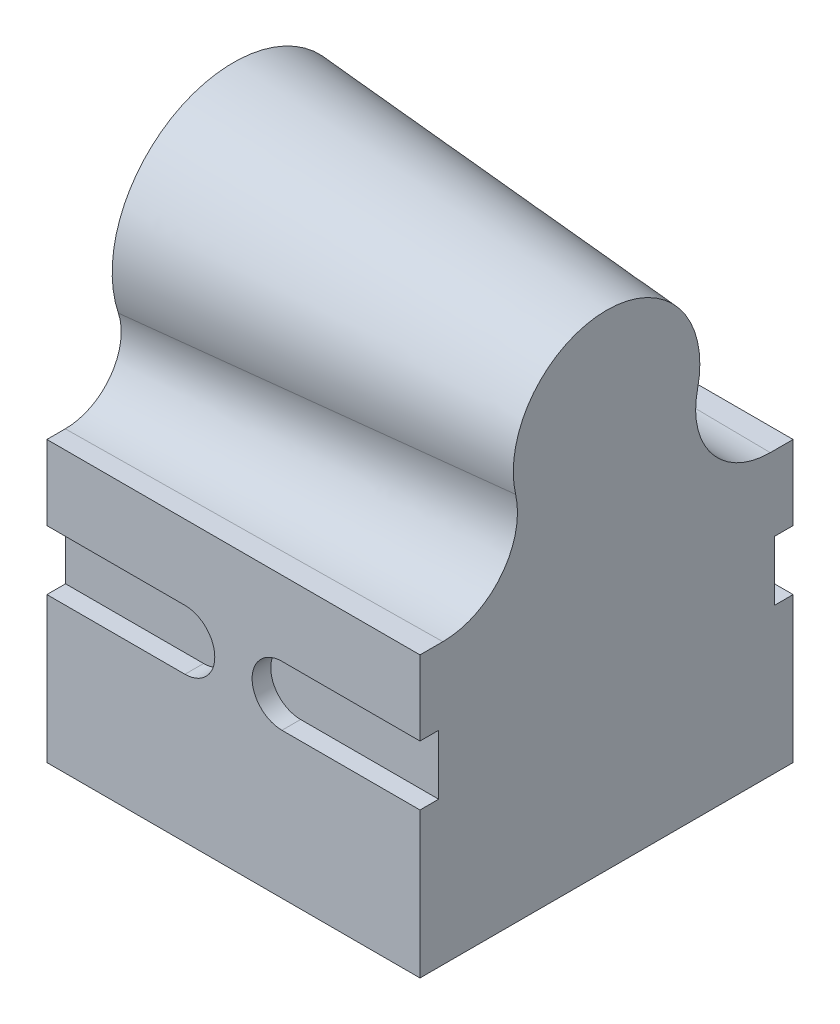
ISO-10303-21;
HEADER;
FILE_DESCRIPTION(('STEP AP214'),'2;1');
FILE_NAME('part.step','',(''),(''),'','','');
FILE_SCHEMA(('AUTOMOTIVE_DESIGN { 1 0 10303 214 1 1 1 1 }'));
ENDSEC;
DATA;
#1=APPLICATION_CONTEXT('core data for automotive mechanical design processes');
#2=APPLICATION_PROTOCOL_DEFINITION('international standard','automotive_design',2000,#1);
#3=PRODUCT_CONTEXT('',#1,'mechanical');
#4=PRODUCT('Part','Part','',(#3));
#5=PRODUCT_RELATED_PRODUCT_CATEGORY('part','',(#4));
#6=PRODUCT_DEFINITION_FORMATION('','',#4);
#7=PRODUCT_DEFINITION_CONTEXT('part definition',#1,'design');
#8=PRODUCT_DEFINITION('design','',#6,#7);
#9=PRODUCT_DEFINITION_SHAPE('','',#8);
#10=(LENGTH_UNIT() NAMED_UNIT(*) SI_UNIT(.MILLI.,.METRE.));
#11=(NAMED_UNIT(*) PLANE_ANGLE_UNIT() SI_UNIT($,.RADIAN.));
#12=(NAMED_UNIT(*) SI_UNIT($,.STERADIAN.) SOLID_ANGLE_UNIT());
#13=UNCERTAINTY_MEASURE_WITH_UNIT(LENGTH_MEASURE(1.E-05),#10,'distance_accuracy_value','');
#14=(GEOMETRIC_REPRESENTATION_CONTEXT(3) GLOBAL_UNCERTAINTY_ASSIGNED_CONTEXT((#13)) GLOBAL_UNIT_ASSIGNED_CONTEXT((#10,
#11,#12)) REPRESENTATION_CONTEXT('',''));
#15=CARTESIAN_POINT('',(0.,0.,0.));
#16=DIRECTION('',(0.,0.,1.));
#17=DIRECTION('',(1.,0.,0.));
#18=AXIS2_PLACEMENT_3D('',#15,#16,#17);
#19=CARTESIAN_POINT('',(-13.,47.,-50.));
#20=DIRECTION('',(0.,0.,1.));
#21=DIRECTION('',(1.,0.,0.));
#22=AXIS2_PLACEMENT_3D('',#19,#20,#21);
#23=CYLINDRICAL_SURFACE('',#22,7.99999999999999);
#24=DIRECTION('',(0.,0.,1.));
#25=VECTOR('',#24,1.);
#26=CARTESIAN_POINT('',(-13.,55.,-45.));
#27=LINE('',#26,#25);
#28=CARTESIAN_POINT('',(-13.,55.,-50.));
#29=VERTEX_POINT('',#28);
#30=CARTESIAN_POINT('',(-13.,55.,-45.));
#31=VERTEX_POINT('',#30);
#32=EDGE_CURVE('E899',#29,#31,#27,.T.);
#33=ORIENTED_EDGE('',*,*,#32,.F.);
#34=CARTESIAN_POINT('',(-13.,47.,-50.));
#35=DIRECTION('',(0.,0.,1.));
#36=DIRECTION('',(1.,0.,0.));
#37=AXIS2_PLACEMENT_3D('',#34,#35,#36);
#38=CIRCLE('',#37,7.99999999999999);
#39=CARTESIAN_POINT('',(-13.,39.,-50.));
#40=VERTEX_POINT('',#39);
#41=EDGE_CURVE('E12',#29,#40,#38,.F.);
#42=ORIENTED_EDGE('',*,*,#41,.T.);
#43=DIRECTION('',(0.,0.,1.));
#44=VECTOR('',#43,1.);
#45=CARTESIAN_POINT('',(-13.,39.,-45.));
#46=LINE('',#45,#44);
#47=CARTESIAN_POINT('',(-13.,39.,-45.));
#48=VERTEX_POINT('',#47);
#49=EDGE_CURVE('E902',#48,#40,#46,.F.);
#50=ORIENTED_EDGE('',*,*,#49,.F.);
#51=CARTESIAN_POINT('',(-13.,47.,-45.));
#52=DIRECTION('',(0.,0.,1.));
#53=DIRECTION('',(0.,-1.,0.));
#54=AXIS2_PLACEMENT_3D('',#51,#52,#53);
#55=CIRCLE('',#54,7.99999999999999);
#56=EDGE_CURVE('E102',#31,#48,#55,.F.);
#57=ORIENTED_EDGE('',*,*,#56,.F.);
#58=EDGE_LOOP('',(#33,#42,#50,#57));
#59=FACE_BOUND('',#58,.T.);
#60=ADVANCED_FACE('F94',(#59),#23,.F.);
#61=CARTESIAN_POINT('',(13.,47.,-45.));
#62=DIRECTION('',(0.,0.,1.));
#63=DIRECTION('',(1.,0.,0.));
#64=AXIS2_PLACEMENT_3D('',#61,#62,#63);
#65=CYLINDRICAL_SURFACE('',#64,7.99999999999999);
#66=DIRECTION('',(0.,0.,1.));
#67=VECTOR('',#66,1.);
#68=CARTESIAN_POINT('',(13.,55.,-45.));
#69=LINE('',#68,#67);
#70=CARTESIAN_POINT('',(13.,55.,-45.));
#71=VERTEX_POINT('',#70);
#72=CARTESIAN_POINT('',(13.,55.,-50.));
#73=VERTEX_POINT('',#72);
#74=EDGE_CURVE('E892',#71,#73,#69,.F.);
#75=ORIENTED_EDGE('',*,*,#74,.F.);
#76=CARTESIAN_POINT('',(13.,47.,-45.));
#77=DIRECTION('',(0.,0.,1.));
#78=DIRECTION('',(0.,-1.,0.));
#79=AXIS2_PLACEMENT_3D('',#76,#77,#78);
#80=CIRCLE('',#79,7.99999999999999);
#81=CARTESIAN_POINT('',(13.,39.,-45.));
#82=VERTEX_POINT('',#81);
#83=EDGE_CURVE('E896',#82,#71,#80,.F.);
#84=ORIENTED_EDGE('',*,*,#83,.F.);
#85=DIRECTION('',(0.,0.,1.));
#86=VECTOR('',#85,1.);
#87=CARTESIAN_POINT('',(13.,39.,-45.));
#88=LINE('',#87,#86);
#89=CARTESIAN_POINT('',(13.,39.,-50.));
#90=VERTEX_POINT('',#89);
#91=EDGE_CURVE('E843',#90,#82,#88,.T.);
#92=ORIENTED_EDGE('',*,*,#91,.F.);
#93=CARTESIAN_POINT('',(13.,47.,-50.));
#94=DIRECTION('',(0.,0.,1.));
#95=DIRECTION('',(1.,0.,0.));
#96=AXIS2_PLACEMENT_3D('',#93,#94,#95);
#97=CIRCLE('',#96,7.99999999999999);
#98=EDGE_CURVE('E837',#90,#73,#97,.F.);
#99=ORIENTED_EDGE('',*,*,#98,.T.);
#100=EDGE_LOOP('',(#75,#84,#92,#99));
#101=FACE_BOUND('',#100,.T.);
#102=ADVANCED_FACE('F674',(#101),#65,.F.);
#103=CARTESIAN_POINT('',(13.,47.,50.));
#104=DIRECTION('',(0.,0.,-1.));
#105=DIRECTION('',(-1.,0.,0.));
#106=AXIS2_PLACEMENT_3D('',#103,#104,#105);
#107=CYLINDRICAL_SURFACE('',#106,8.);
#108=DIRECTION('',(0.,0.,-1.));
#109=VECTOR('',#108,1.);
#110=CARTESIAN_POINT('',(13.,55.,55.));
#111=LINE('',#110,#109);
#112=CARTESIAN_POINT('',(13.,55.,50.));
#113=VERTEX_POINT('',#112);
#114=CARTESIAN_POINT('',(13.,55.,45.));
#115=VERTEX_POINT('',#114);
#116=EDGE_CURVE('E554',#113,#115,#111,.T.);
#117=ORIENTED_EDGE('',*,*,#116,.F.);
#118=CARTESIAN_POINT('',(13.,47.,50.));
#119=DIRECTION('',(0.,0.,-1.));
#120=DIRECTION('',(-1.,0.,0.));
#121=AXIS2_PLACEMENT_3D('',#118,#119,#120);
#122=CIRCLE('',#121,8.);
#123=CARTESIAN_POINT('',(13.,39.,50.));
#124=VERTEX_POINT('',#123);
#125=EDGE_CURVE('E549',#113,#124,#122,.F.);
#126=ORIENTED_EDGE('',*,*,#125,.T.);
#127=DIRECTION('',(0.,0.,-1.));
#128=VECTOR('',#127,1.);
#129=CARTESIAN_POINT('',(13.,39.,55.));
#130=LINE('',#129,#128);
#131=CARTESIAN_POINT('',(13.,39.,45.));
#132=VERTEX_POINT('',#131);
#133=EDGE_CURVE('E888',#132,#124,#130,.F.);
#134=ORIENTED_EDGE('',*,*,#133,.F.);
#135=CARTESIAN_POINT('',(13.,47.,45.));
#136=DIRECTION('',(0.,0.,-1.));
#137=DIRECTION('',(-1.,0.,0.));
#138=AXIS2_PLACEMENT_3D('',#135,#136,#137);
#139=CIRCLE('',#138,8.);
#140=EDGE_CURVE('E260',#115,#132,#139,.F.);
#141=ORIENTED_EDGE('',*,*,#140,.F.);
#142=EDGE_LOOP('',(#117,#126,#134,#141));
#143=FACE_BOUND('',#142,.T.);
#144=ADVANCED_FACE('F650',(#143),#107,.F.);
#145=CARTESIAN_POINT('',(-13.,47.,45.));
#146=DIRECTION('',(0.,0.,1.));
#147=DIRECTION('',(1.,0.,0.));
#148=AXIS2_PLACEMENT_3D('',#145,#146,#147);
#149=CYLINDRICAL_SURFACE('',#148,8.);
#150=DIRECTION('',(0.,0.,1.));
#151=VECTOR('',#150,1.);
#152=CARTESIAN_POINT('',(-13.,55.,55.));
#153=LINE('',#152,#151);
#154=CARTESIAN_POINT('',(-13.,55.,45.));
#155=VERTEX_POINT('',#154);
#156=CARTESIAN_POINT('',(-13.,55.,50.));
#157=VERTEX_POINT('',#156);
#158=EDGE_CURVE('E274',#155,#157,#153,.T.);
#159=ORIENTED_EDGE('',*,*,#158,.F.);
#160=CARTESIAN_POINT('',(-13.,47.,45.));
#161=DIRECTION('',(0.,0.,-1.));
#162=DIRECTION('',(-1.,0.,0.));
#163=AXIS2_PLACEMENT_3D('',#160,#161,#162);
#164=CIRCLE('',#163,8.);
#165=CARTESIAN_POINT('',(-13.,39.,45.));
#166=VERTEX_POINT('',#165);
#167=EDGE_CURVE('E818',#166,#155,#164,.F.);
#168=ORIENTED_EDGE('',*,*,#167,.F.);
#169=DIRECTION('',(0.,0.,1.));
#170=VECTOR('',#169,1.);
#171=CARTESIAN_POINT('',(-13.,39.,55.));
#172=LINE('',#171,#170);
#173=CARTESIAN_POINT('',(-13.,39.,50.));
#174=VERTEX_POINT('',#173);
#175=EDGE_CURVE('E825',#174,#166,#172,.F.);
#176=ORIENTED_EDGE('',*,*,#175,.F.);
#177=CARTESIAN_POINT('',(-13.,47.,50.));
#178=DIRECTION('',(0.,0.,-1.));
#179=DIRECTION('',(-1.,0.,0.));
#180=AXIS2_PLACEMENT_3D('',#177,#178,#179);
#181=CIRCLE('',#180,8.);
#182=EDGE_CURVE('E885',#174,#157,#181,.F.);
#183=ORIENTED_EDGE('',*,*,#182,.T.);
#184=EDGE_LOOP('',(#159,#168,#176,#183));
#185=FACE_BOUND('',#184,.T.);
#186=ADVANCED_FACE('F596',(#185),#149,.F.);
#187=CARTESIAN_POINT('',(-50.008573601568,55.,-45.));
#188=DIRECTION('',(0.,0.,1.));
#189=DIRECTION('',(0.,-1.,0.));
#190=AXIS2_PLACEMENT_3D('',#187,#188,#189);
#191=PLANE('',#190);
#192=DIRECTION('',(1.,0.,0.));
#193=VECTOR('',#192,1.);
#194=CARTESIAN_POINT('',(-50.008573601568,39.,-45.));
#195=LINE('',#194,#193);
#196=CARTESIAN_POINT('',(50.,39.,-45.));
#197=VERTEX_POINT('',#196);
#198=EDGE_CURVE('E286',#82,#197,#195,.T.);
#199=ORIENTED_EDGE('',*,*,#198,.F.);
#200=ORIENTED_EDGE('',*,*,#83,.T.);
#201=DIRECTION('',(1.,0.,0.));
#202=VECTOR('',#201,1.);
#203=CARTESIAN_POINT('',(-50.008573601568,55.,-45.));
#204=LINE('',#203,#202);
#205=CARTESIAN_POINT('',(50.,55.,-45.));
#206=VERTEX_POINT('',#205);
#207=EDGE_CURVE('E302',#71,#206,#204,.T.);
#208=ORIENTED_EDGE('',*,*,#207,.T.);
#209=DIRECTION('',(0.,-1.,0.));
#210=VECTOR('',#209,1.);
#211=CARTESIAN_POINT('',(50.,55.,-45.));
#212=LINE('',#211,#210);
#213=EDGE_CURVE('E297',#206,#197,#212,.T.);
#214=ORIENTED_EDGE('',*,*,#213,.T.);
#215=EDGE_LOOP('',(#199,#200,#208,#214));
#216=FACE_BOUND('',#215,.T.);
#217=ADVANCED_FACE('F590',(#216),#191,.F.);
#218=CARTESIAN_POINT('',(-50.008573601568,39.,-45.));
#219=DIRECTION('',(0.,-1.,0.));
#220=DIRECTION('',(0.,0.,-1.));
#221=AXIS2_PLACEMENT_3D('',#218,#219,#220);
#222=PLANE('',#221);
#223=DIRECTION('',(1.,0.,0.));
#224=VECTOR('',#223,1.);
#225=CARTESIAN_POINT('',(50.,39.,-50.));
#226=LINE('',#225,#224);
#227=CARTESIAN_POINT('',(50.,39.,-50.));
#228=VERTEX_POINT('',#227);
#229=EDGE_CURVE('E835',#90,#228,#226,.T.);
#230=ORIENTED_EDGE('',*,*,#229,.F.);
#231=ORIENTED_EDGE('',*,*,#91,.T.);
#232=ORIENTED_EDGE('',*,*,#198,.T.);
#233=DIRECTION('',(0.,0.,-1.));
#234=VECTOR('',#233,1.);
#235=CARTESIAN_POINT('',(50.,39.,-45.));
#236=LINE('',#235,#234);
#237=EDGE_CURVE('E300',#197,#228,#236,.T.);
#238=ORIENTED_EDGE('',*,*,#237,.T.);
#239=EDGE_LOOP('',(#230,#231,#232,#238));
#240=FACE_BOUND('',#239,.T.);
#241=ADVANCED_FACE('F595',(#240),#222,.F.);
#242=CARTESIAN_POINT('',(-50.008573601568,55.,-45.));
#243=DIRECTION('',(0.,1.,0.));
#244=DIRECTION('',(0.,0.,1.));
#245=AXIS2_PLACEMENT_3D('',#242,#243,#244);
#246=PLANE('',#245);
#247=ORIENTED_EDGE('',*,*,#207,.F.);
#248=ORIENTED_EDGE('',*,*,#74,.T.);
#249=DIRECTION('',(-1.,0.,0.));
#250=VECTOR('',#249,1.);
#251=CARTESIAN_POINT('',(50.,55.,-50.));
#252=LINE('',#251,#250);
#253=CARTESIAN_POINT('',(50.,55.,-50.));
#254=VERTEX_POINT('',#253);
#255=EDGE_CURVE('E840',#254,#73,#252,.T.);
#256=ORIENTED_EDGE('',*,*,#255,.F.);
#257=DIRECTION('',(0.,0.,1.));
#258=VECTOR('',#257,1.);
#259=CARTESIAN_POINT('',(50.,55.,-45.));
#260=LINE('',#259,#258);
#261=EDGE_CURVE('E294',#254,#206,#260,.T.);
#262=ORIENTED_EDGE('',*,*,#261,.T.);
#263=EDGE_LOOP('',(#247,#248,#256,#262));
#264=FACE_BOUND('',#263,.T.);
#265=ADVANCED_FACE('F567',(#264),#246,.F.);
#266=CARTESIAN_POINT('',(-50.008573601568,55.,45.));
#267=DIRECTION('',(0.,0.,-1.));
#268=DIRECTION('',(-1.,0.,0.));
#269=AXIS2_PLACEMENT_3D('',#266,#267,#268);
#270=PLANE('',#269);
#271=DIRECTION('',(1.,0.,0.));
#272=VECTOR('',#271,1.);
#273=CARTESIAN_POINT('',(-50.008573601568,55.,45.));
#274=LINE('',#273,#272);
#275=CARTESIAN_POINT('',(50.,55.,45.));
#276=VERTEX_POINT('',#275);
#277=EDGE_CURVE('E283',#115,#276,#274,.T.);
#278=ORIENTED_EDGE('',*,*,#277,.F.);
#279=ORIENTED_EDGE('',*,*,#140,.T.);
#280=DIRECTION('',(1.,0.,0.));
#281=VECTOR('',#280,1.);
#282=CARTESIAN_POINT('',(-50.008573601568,39.,45.));
#283=LINE('',#282,#281);
#284=CARTESIAN_POINT('',(50.,39.,45.));
#285=VERTEX_POINT('',#284);
#286=EDGE_CURVE('E253',#132,#285,#283,.T.);
#287=ORIENTED_EDGE('',*,*,#286,.T.);
#288=DIRECTION('',(0.,1.,0.));
#289=VECTOR('',#288,1.);
#290=CARTESIAN_POINT('',(50.,55.,45.));
#291=LINE('',#290,#289);
#292=EDGE_CURVE('E258',#285,#276,#291,.T.);
#293=ORIENTED_EDGE('',*,*,#292,.T.);
#294=EDGE_LOOP('',(#278,#279,#287,#293));
#295=FACE_BOUND('',#294,.T.);
#296=ADVANCED_FACE('F256',(#295),#270,.F.);
#297=CARTESIAN_POINT('',(-50.008573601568,39.,55.));
#298=DIRECTION('',(0.,-1.,0.));
#299=DIRECTION('',(0.,0.,-1.));
#300=AXIS2_PLACEMENT_3D('',#297,#298,#299);
#301=PLANE('',#300);
#302=ORIENTED_EDGE('',*,*,#286,.F.);
#303=ORIENTED_EDGE('',*,*,#133,.T.);
#304=DIRECTION('',(-1.,0.,0.));
#305=VECTOR('',#304,1.);
#306=CARTESIAN_POINT('',(50.,39.,50.));
#307=LINE('',#306,#305);
#308=CARTESIAN_POINT('',(50.,39.,50.));
#309=VERTEX_POINT('',#308);
#310=EDGE_CURVE('E271',#309,#124,#307,.T.);
#311=ORIENTED_EDGE('',*,*,#310,.F.);
#312=DIRECTION('',(0.,0.,1.));
#313=VECTOR('',#312,1.);
#314=CARTESIAN_POINT('',(50.,39.,-50.));
#315=LINE('',#314,#313);
#316=EDGE_CURVE('E268',#285,#309,#315,.T.);
#317=ORIENTED_EDGE('',*,*,#316,.F.);
#318=EDGE_LOOP('',(#302,#303,#311,#317));
#319=FACE_BOUND('',#318,.T.);
#320=ADVANCED_FACE('F269',(#319),#301,.F.);
#321=CARTESIAN_POINT('',(-50.008573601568,55.,55.));
#322=DIRECTION('',(0.,1.,0.));
#323=DIRECTION('',(0.,0.,1.));
#324=AXIS2_PLACEMENT_3D('',#321,#322,#323);
#325=PLANE('',#324);
#326=DIRECTION('',(1.,0.,0.));
#327=VECTOR('',#326,1.);
#328=CARTESIAN_POINT('',(50.,55.,50.));
#329=LINE('',#328,#327);
#330=CARTESIAN_POINT('',(50.,55.,50.));
#331=VERTEX_POINT('',#330);
#332=EDGE_CURVE('E315',#113,#331,#329,.T.);
#333=ORIENTED_EDGE('',*,*,#332,.F.);
#334=ORIENTED_EDGE('',*,*,#116,.T.);
#335=ORIENTED_EDGE('',*,*,#277,.T.);
#336=DIRECTION('',(0.,0.,1.));
#337=VECTOR('',#336,1.);
#338=CARTESIAN_POINT('',(50.,55.,55.));
#339=LINE('',#338,#337);
#340=EDGE_CURVE('E280',#276,#331,#339,.T.);
#341=ORIENTED_EDGE('',*,*,#340,.T.);
#342=EDGE_LOOP('',(#333,#334,#335,#341));
#343=FACE_BOUND('',#342,.T.);
#344=ADVANCED_FACE('F553',(#343),#325,.F.);
#345=CARTESIAN_POINT('',(0.,75.,0.));
#346=DIRECTION('',(0.,-1.,0.));
#347=DIRECTION('',(0.,0.,-1.));
#348=AXIS2_PLACEMENT_3D('',#345,#346,#347);
#349=PLANE('',#348);
#350=DIRECTION('',(-0.999928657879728,0.,-0.0119448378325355));
#351=VECTOR('',#350,1.);
#352=CARTESIAN_POINT('',(0.,75.,-44.4721064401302));
#353=LINE('',#352,#351);
#354=CARTESIAN_POINT('',(50.,75.,-43.8748219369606));
#355=VERTEX_POINT('',#354);
#356=CARTESIAN_POINT('',(-50.,75.,-45.0693909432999));
#357=VERTEX_POINT('',#356);
#358=EDGE_CURVE('E467',#355,#357,#353,.T.);
#359=ORIENTED_EDGE('',*,*,#358,.F.);
#360=DIRECTION('',(0.,0.,-1.));
#361=VECTOR('',#360,1.);
#362=CARTESIAN_POINT('',(50.,75.,-50.));
#363=LINE('',#362,#361);
#364=CARTESIAN_POINT('',(50.,75.,-50.));
#365=VERTEX_POINT('',#364);
#366=EDGE_CURVE('E537',#355,#365,#363,.T.);
#367=ORIENTED_EDGE('',*,*,#366,.T.);
#368=DIRECTION('',(-1.,0.,0.));
#369=VECTOR('',#368,1.);
#370=CARTESIAN_POINT('',(50.,75.,-50.));
#371=LINE('',#370,#369);
#372=CARTESIAN_POINT('',(-50.,75.,-50.));
#373=VERTEX_POINT('',#372);
#374=EDGE_CURVE('E532',#365,#373,#371,.T.);
#375=ORIENTED_EDGE('',*,*,#374,.T.);
#376=DIRECTION('',(0.,0.,1.));
#377=VECTOR('',#376,1.);
#378=CARTESIAN_POINT('',(-50.,75.,-50.));
#379=LINE('',#378,#377);
#380=EDGE_CURVE('E503',#373,#357,#379,.T.);
#381=ORIENTED_EDGE('',*,*,#380,.T.);
#382=EDGE_LOOP('',(#359,#367,#375,#381));
#383=FACE_BOUND('',#382,.T.);
#384=ADVANCED_FACE('F580',(#383),#349,.F.);
#385=DIRECTION('',(-0.999928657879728,0.,0.0119448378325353));
#386=VECTOR('',#385,1.);
#387=CARTESIAN_POINT('',(0.,75.,44.4721064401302));
#388=LINE('',#387,#386);
#389=CARTESIAN_POINT('',(50.,75.,43.8748219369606));
#390=VERTEX_POINT('',#389);
#391=CARTESIAN_POINT('',(-50.,75.,45.0693909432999));
#392=VERTEX_POINT('',#391);
#393=EDGE_CURVE('E417',#390,#392,#388,.T.);
#394=ORIENTED_EDGE('',*,*,#393,.T.);
#395=CARTESIAN_POINT('',(-50.,75.,50.));
#396=VERTEX_POINT('',#395);
#397=EDGE_CURVE('E500',#392,#396,#379,.T.);
#398=ORIENTED_EDGE('',*,*,#397,.T.);
#399=DIRECTION('',(1.,0.,0.));
#400=VECTOR('',#399,1.);
#401=CARTESIAN_POINT('',(50.,75.,50.));
#402=LINE('',#401,#400);
#403=CARTESIAN_POINT('',(50.,75.,50.));
#404=VERTEX_POINT('',#403);
#405=EDGE_CURVE('E496',#396,#404,#402,.T.);
#406=ORIENTED_EDGE('',*,*,#405,.T.);
#407=EDGE_CURVE('E459',#404,#390,#363,.T.);
#408=ORIENTED_EDGE('',*,*,#407,.T.);
#409=EDGE_LOOP('',(#394,#398,#406,#408));
#410=FACE_BOUND('',#409,.T.);
#411=ADVANCED_FACE('F545',(#410),#349,.F.);
#412=CARTESIAN_POINT('',(-50.,75.,-50.));
#413=DIRECTION('',(1.,0.,0.));
#414=DIRECTION('',(0.,0.,-1.));
#415=AXIS2_PLACEMENT_3D('',#412,#413,#414);
#416=PLANE('',#415);
#417=DIRECTION('',(0.,-1.,0.));
#418=VECTOR('',#417,1.);
#419=CARTESIAN_POINT('',(-50.,75.,50.));
#420=LINE('',#419,#418);
#421=CARTESIAN_POINT('',(-50.,39.,50.));
#422=VERTEX_POINT('',#421);
#423=CARTESIAN_POINT('',(-50.,0.,50.));
#424=VERTEX_POINT('',#423);
#425=EDGE_CURVE('E509',#422,#424,#420,.T.);
#426=ORIENTED_EDGE('',*,*,#425,.F.);
#427=DIRECTION('',(0.,0.,-1.));
#428=VECTOR('',#427,1.);
#429=CARTESIAN_POINT('',(-50.,39.,-50.));
#430=LINE('',#429,#428);
#431=CARTESIAN_POINT('',(-50.,39.,45.));
#432=VERTEX_POINT('',#431);
#433=EDGE_CURVE('E324',#422,#432,#430,.T.);
#434=ORIENTED_EDGE('',*,*,#433,.T.);
#435=DIRECTION('',(0.,1.,0.));
#436=VECTOR('',#435,1.);
#437=CARTESIAN_POINT('',(-50.,75.,45.));
#438=LINE('',#437,#436);
#439=CARTESIAN_POINT('',(-50.,55.,45.));
#440=VERTEX_POINT('',#439);
#441=EDGE_CURVE('E327',#432,#440,#438,.T.);
#442=ORIENTED_EDGE('',*,*,#441,.T.);
#443=DIRECTION('',(0.,0.,1.));
#444=VECTOR('',#443,1.);
#445=CARTESIAN_POINT('',(-50.,55.,-50.));
#446=LINE('',#445,#444);
#447=CARTESIAN_POINT('',(-50.,55.,50.));
#448=VERTEX_POINT('',#447);
#449=EDGE_CURVE('E319',#440,#448,#446,.T.);
#450=ORIENTED_EDGE('',*,*,#449,.T.);
#451=EDGE_CURVE('E505',#396,#448,#420,.T.);
#452=ORIENTED_EDGE('',*,*,#451,.F.);
#453=ORIENTED_EDGE('',*,*,#397,.F.);
#454=CARTESIAN_POINT('',(-50.,90.,45.0693909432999));
#455=DIRECTION('',(1.,0.,0.));
#456=DIRECTION('',(0.,0.,1.));
#457=AXIS2_PLACEMENT_3D('',#454,#455,#456);
#458=CIRCLE('',#457,15.);
#459=CARTESIAN_POINT('',(-50.,94.7368421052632,30.8369516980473));
#460=VERTEX_POINT('',#459);
#461=EDGE_CURVE('E418',#392,#460,#458,.T.);
#462=ORIENTED_EDGE('',*,*,#461,.T.);
#463=CARTESIAN_POINT('',(-50.,105.,0.));
#464=DIRECTION('',(-1.,0.,0.));
#465=DIRECTION('',(0.,0.,1.));
#466=AXIS2_PLACEMENT_3D('',#463,#464,#465);
#467=CIRCLE('',#466,32.5);
#468=CARTESIAN_POINT('',(-50.,94.7368421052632,-30.8369516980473));
#469=VERTEX_POINT('',#468);
#470=EDGE_CURVE('E416',#460,#469,#467,.T.);
#471=ORIENTED_EDGE('',*,*,#470,.T.);
#472=CARTESIAN_POINT('',(-50.,90.,-45.0693909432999));
#473=DIRECTION('',(1.,0.,0.));
#474=DIRECTION('',(0.,0.,1.));
#475=AXIS2_PLACEMENT_3D('',#472,#473,#474);
#476=CIRCLE('',#475,15.);
#477=EDGE_CURVE('E392',#469,#357,#476,.T.);
#478=ORIENTED_EDGE('',*,*,#477,.T.);
#479=ORIENTED_EDGE('',*,*,#380,.F.);
#480=DIRECTION('',(0.,-1.,0.));
#481=VECTOR('',#480,1.);
#482=CARTESIAN_POINT('',(-50.,75.,-50.));
#483=LINE('',#482,#481);
#484=CARTESIAN_POINT('',(-50.,55.,-50.));
#485=VERTEX_POINT('',#484);
#486=EDGE_CURVE('E517',#373,#485,#483,.T.);
#487=ORIENTED_EDGE('',*,*,#486,.T.);
#488=DIRECTION('',(0.,0.,1.));
#489=VECTOR('',#488,1.);
#490=CARTESIAN_POINT('',(-50.,55.,-50.));
#491=LINE('',#490,#489);
#492=CARTESIAN_POINT('',(-50.,55.,-45.));
#493=VERTEX_POINT('',#492);
#494=EDGE_CURVE('E291',#485,#493,#491,.T.);
#495=ORIENTED_EDGE('',*,*,#494,.T.);
#496=DIRECTION('',(0.,-1.,0.));
#497=VECTOR('',#496,1.);
#498=CARTESIAN_POINT('',(-50.,75.,-45.));
#499=LINE('',#498,#497);
#500=CARTESIAN_POINT('',(-50.,39.,-45.));
#501=VERTEX_POINT('',#500);
#502=EDGE_CURVE('E312',#493,#501,#499,.T.);
#503=ORIENTED_EDGE('',*,*,#502,.T.);
#504=DIRECTION('',(0.,0.,-1.));
#505=VECTOR('',#504,1.);
#506=CARTESIAN_POINT('',(-50.,39.,-50.));
#507=LINE('',#506,#505);
#508=CARTESIAN_POINT('',(-50.,39.,-50.));
#509=VERTEX_POINT('',#508);
#510=EDGE_CURVE('E309',#501,#509,#507,.T.);
#511=ORIENTED_EDGE('',*,*,#510,.T.);
#512=CARTESIAN_POINT('',(-50.,0.,-50.));
#513=VERTEX_POINT('',#512);
#514=EDGE_CURVE('E520',#509,#513,#483,.T.);
#515=ORIENTED_EDGE('',*,*,#514,.T.);
#516=DIRECTION('',(0.,0.,1.));
#517=VECTOR('',#516,1.);
#518=CARTESIAN_POINT('',(-50.,0.,-50.));
#519=LINE('',#518,#517);
#520=EDGE_CURVE('E491',#513,#424,#519,.T.);
#521=ORIENTED_EDGE('',*,*,#520,.T.);
#522=EDGE_LOOP('',(#426,#434,#442,#450,#452,#453,#462,#471,#478,#479,#487,#495,#503,#511,#515,#521));
#523=FACE_BOUND('',#522,.T.);
#524=ADVANCED_FACE('F630',(#523),#416,.F.);
#525=CARTESIAN_POINT('',(50.,75.,50.));
#526=DIRECTION('',(0.,0.,-1.));
#527=DIRECTION('',(-1.,0.,0.));
#528=AXIS2_PLACEMENT_3D('',#525,#526,#527);
#529=PLANE('',#528);
#530=ORIENTED_EDGE('',*,*,#125,.F.);
#531=ORIENTED_EDGE('',*,*,#332,.T.);
#532=DIRECTION('',(0.,-1.,0.));
#533=VECTOR('',#532,1.);
#534=CARTESIAN_POINT('',(50.,75.,50.));
#535=LINE('',#534,#533);
#536=EDGE_CURVE('E510',#404,#331,#535,.T.);
#537=ORIENTED_EDGE('',*,*,#536,.F.);
#538=ORIENTED_EDGE('',*,*,#405,.F.);
#539=ORIENTED_EDGE('',*,*,#451,.T.);
#540=EDGE_CURVE('E316',#448,#157,#329,.T.);
#541=ORIENTED_EDGE('',*,*,#540,.T.);
#542=ORIENTED_EDGE('',*,*,#182,.F.);
#543=EDGE_CURVE('E322',#174,#422,#307,.T.);
#544=ORIENTED_EDGE('',*,*,#543,.T.);
#545=ORIENTED_EDGE('',*,*,#425,.T.);
#546=DIRECTION('',(1.,0.,0.));
#547=VECTOR('',#546,1.);
#548=CARTESIAN_POINT('',(50.,0.,50.));
#549=LINE('',#548,#547);
#550=CARTESIAN_POINT('',(50.,0.,50.));
#551=VERTEX_POINT('',#550);
#552=EDGE_CURVE('E527',#424,#551,#549,.T.);
#553=ORIENTED_EDGE('',*,*,#552,.T.);
#554=EDGE_CURVE('E512',#309,#551,#535,.T.);
#555=ORIENTED_EDGE('',*,*,#554,.F.);
#556=ORIENTED_EDGE('',*,*,#310,.T.);
#557=EDGE_LOOP('',(#530,#531,#537,#538,#539,#541,#542,#544,#545,#553,#555,#556));
#558=FACE_BOUND('',#557,.T.);
#559=ADVANCED_FACE('F438',(#558),#529,.F.);
#560=CARTESIAN_POINT('',(50.,75.,-50.));
#561=DIRECTION('',(-1.,0.,0.));
#562=DIRECTION('',(0.,0.,1.));
#563=AXIS2_PLACEMENT_3D('',#560,#561,#562);
#564=PLANE('',#563);
#565=ORIENTED_EDGE('',*,*,#292,.F.);
#566=ORIENTED_EDGE('',*,*,#316,.T.);
#567=ORIENTED_EDGE('',*,*,#554,.T.);
#568=DIRECTION('',(0.,0.,-1.));
#569=VECTOR('',#568,1.);
#570=CARTESIAN_POINT('',(50.,0.,-50.));
#571=LINE('',#570,#569);
#572=CARTESIAN_POINT('',(50.,0.,-50.));
#573=VERTEX_POINT('',#572);
#574=EDGE_CURVE('E524',#551,#573,#571,.T.);
#575=ORIENTED_EDGE('',*,*,#574,.T.);
#576=DIRECTION('',(0.,-1.,0.));
#577=VECTOR('',#576,1.);
#578=CARTESIAN_POINT('',(50.,75.,-50.));
#579=LINE('',#578,#577);
#580=EDGE_CURVE('E516',#228,#573,#579,.T.);
#581=ORIENTED_EDGE('',*,*,#580,.F.);
#582=ORIENTED_EDGE('',*,*,#237,.F.);
#583=ORIENTED_EDGE('',*,*,#213,.F.);
#584=ORIENTED_EDGE('',*,*,#261,.F.);
#585=EDGE_CURVE('E513',#365,#254,#579,.T.);
#586=ORIENTED_EDGE('',*,*,#585,.F.);
#587=ORIENTED_EDGE('',*,*,#366,.F.);
#588=CARTESIAN_POINT('',(50.,95.,-43.8748219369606));
#589=DIRECTION('',(-1.,0.,0.));
#590=DIRECTION('',(0.,0.,-1.));
#591=AXIS2_PLACEMENT_3D('',#588,#589,#590);
#592=CIRCLE('',#591,20.);
#593=CARTESIAN_POINT('',(50.,99.4444444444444,-24.3749010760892));
#594=VERTEX_POINT('',#593);
#595=EDGE_CURVE('E330',#355,#594,#592,.T.);
#596=ORIENTED_EDGE('',*,*,#595,.T.);
#597=CARTESIAN_POINT('',(50.,105.,0.));
#598=DIRECTION('',(1.,0.,0.));
#599=DIRECTION('',(0.,0.,-1.));
#600=AXIS2_PLACEMENT_3D('',#597,#598,#599);
#601=CIRCLE('',#600,25.);
#602=CARTESIAN_POINT('',(50.,99.4444444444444,24.3749010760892));
#603=VERTEX_POINT('',#602);
#604=EDGE_CURVE('E335',#594,#603,#601,.T.);
#605=ORIENTED_EDGE('',*,*,#604,.T.);
#606=CARTESIAN_POINT('',(50.,95.,43.8748219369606));
#607=DIRECTION('',(-1.,0.,0.));
#608=DIRECTION('',(0.,0.,-1.));
#609=AXIS2_PLACEMENT_3D('',#606,#607,#608);
#610=CIRCLE('',#609,20.);
#611=EDGE_CURVE('E407',#603,#390,#610,.T.);
#612=ORIENTED_EDGE('',*,*,#611,.T.);
#613=ORIENTED_EDGE('',*,*,#407,.F.);
#614=ORIENTED_EDGE('',*,*,#536,.T.);
#615=ORIENTED_EDGE('',*,*,#340,.F.);
#616=EDGE_LOOP('',(#565,#566,#567,#575,#581,#582,#583,#584,#586,#587,#596,#605,#612,#613,#614,#615));
#617=FACE_BOUND('',#616,.T.);
#618=ADVANCED_FACE('F277',(#617),#564,.F.);
#619=CARTESIAN_POINT('',(50.,75.,-50.));
#620=DIRECTION('',(0.,0.,1.));
#621=DIRECTION('',(1.,0.,0.));
#622=AXIS2_PLACEMENT_3D('',#619,#620,#621);
#623=PLANE('',#622);
#624=ORIENTED_EDGE('',*,*,#41,.F.);
#625=EDGE_CURVE('E508',#29,#485,#252,.T.);
#626=ORIENTED_EDGE('',*,*,#625,.T.);
#627=ORIENTED_EDGE('',*,*,#486,.F.);
#628=ORIENTED_EDGE('',*,*,#374,.F.);
#629=ORIENTED_EDGE('',*,*,#585,.T.);
#630=ORIENTED_EDGE('',*,*,#255,.T.);
#631=ORIENTED_EDGE('',*,*,#98,.F.);
#632=ORIENTED_EDGE('',*,*,#229,.T.);
#633=ORIENTED_EDGE('',*,*,#580,.T.);
#634=DIRECTION('',(-1.,0.,0.));
#635=VECTOR('',#634,1.);
#636=CARTESIAN_POINT('',(50.,0.,-50.));
#637=LINE('',#636,#635);
#638=EDGE_CURVE('E521',#573,#513,#637,.T.);
#639=ORIENTED_EDGE('',*,*,#638,.T.);
#640=ORIENTED_EDGE('',*,*,#514,.F.);
#641=EDGE_CURVE('E275',#509,#40,#226,.T.);
#642=ORIENTED_EDGE('',*,*,#641,.T.);
#643=EDGE_LOOP('',(#624,#626,#627,#628,#629,#630,#631,#632,#633,#639,#640,#642));
#644=FACE_BOUND('',#643,.T.);
#645=ADVANCED_FACE('F437',(#644),#623,.F.);
#646=CARTESIAN_POINT('',(0.,0.,0.));
#647=DIRECTION('',(0.,-1.,0.));
#648=DIRECTION('',(0.,0.,-1.));
#649=AXIS2_PLACEMENT_3D('',#646,#647,#648);
#650=PLANE('',#649);
#651=ORIENTED_EDGE('',*,*,#520,.F.);
#652=ORIENTED_EDGE('',*,*,#638,.F.);
#653=ORIENTED_EDGE('',*,*,#574,.F.);
#654=ORIENTED_EDGE('',*,*,#552,.F.);
#655=EDGE_LOOP('',(#651,#652,#653,#654));
#656=FACE_BOUND('',#655,.T.);
#657=ADVANCED_FACE('F356',(#656),#650,.T.);
#658=CARTESIAN_POINT('',(50.,99.4444444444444,24.3749010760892));
#659=CARTESIAN_POINT('',(-50.,94.7368421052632,30.8369516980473));
#660=CARTESIAN_POINT('',(50.,101.39938891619,24.8204742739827));
#661=CARTESIAN_POINT('',(-50.,97.0288416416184,31.5997752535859));
#662=CARTESIAN_POINT('',(50.,105.358508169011,25.2269825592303));
#663=CARTESIAN_POINT('',(-50.0000000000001,101.831089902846,32.6279390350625));
#664=CARTESIAN_POINT('',(50.,111.135000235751,24.4621101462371));
#665=CARTESIAN_POINT('',(-50.,109.336745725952,32.5035454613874));
#666=CARTESIAN_POINT('',(50.,116.480798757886,22.4465201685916));
#667=CARTESIAN_POINT('',(-50.,116.736786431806,30.6290983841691));
#668=CARTESIAN_POINT('',(50.,121.167524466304,19.3383754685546));
#669=CARTESIAN_POINT('',(-49.9999999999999,123.595433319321,27.0302051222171));
#670=CARTESIAN_POINT('',(49.9999999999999,125.007905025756,15.3241991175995));
#671=CARTESIAN_POINT('',(-50.0000000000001,129.481008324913,21.8525482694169));
#672=CARTESIAN_POINT('',(50.0000000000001,127.855729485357,10.6120003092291));
#673=CARTESIAN_POINT('',(-50.0000000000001,134.00363501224,15.3611824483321));
#674=CARTESIAN_POINT('',(49.9999999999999,129.606367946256,5.42579679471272));
#675=CARTESIAN_POINT('',(-50.,136.851772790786,7.92695414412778));
#676=CARTESIAN_POINT('',(50.0000000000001,130.196902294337,0.));
#677=CARTESIAN_POINT('',(-50.,137.824416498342,0.));
#678=CARTESIAN_POINT('',(49.9999999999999,129.606367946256,-5.42579679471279));
#679=CARTESIAN_POINT('',(-50.,136.851772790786,-7.92695414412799));
#680=CARTESIAN_POINT('',(50.0000000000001,127.855729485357,-10.6120003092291));
#681=CARTESIAN_POINT('',(-50.,134.00363501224,-15.3611824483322));
#682=CARTESIAN_POINT('',(50.,125.007905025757,-15.3241991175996));
#683=CARTESIAN_POINT('',(-50.,129.481008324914,-21.852548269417));
#684=CARTESIAN_POINT('',(50.,121.167524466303,-19.3383754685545));
#685=CARTESIAN_POINT('',(-50.,123.595433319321,-27.0302051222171));
#686=CARTESIAN_POINT('',(50.0000000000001,116.480798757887,-22.4465201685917));
#687=CARTESIAN_POINT('',(-49.9999999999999,116.736786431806,-30.6290983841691));
#688=CARTESIAN_POINT('',(49.9999999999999,111.13500023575,-24.4621101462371));
#689=CARTESIAN_POINT('',(-50.0000000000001,109.336745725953,-32.5035454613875));
#690=CARTESIAN_POINT('',(50.0000000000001,105.358508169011,-25.2269825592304));
#691=CARTESIAN_POINT('',(-49.9999999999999,101.831089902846,-32.6279390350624));
#692=CARTESIAN_POINT('',(50.,101.39938891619,-24.8204742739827));
#693=CARTESIAN_POINT('',(-50.,97.0288416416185,-31.5997752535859));
#694=CARTESIAN_POINT('',(50.,98.8472909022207,-24.2387971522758));
#695=CARTESIAN_POINT('',(-50.,94.036732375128,-30.6039410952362));
#696=CARTESIAN_POINT('',(50.,97.6066298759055,-24.013490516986));
#697=CARTESIAN_POINT('',(-50.,92.6826580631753,-30.2662975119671));
#698=CARTESIAN_POINT('',(50.,95.6153702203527,-23.8492766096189));
#699=CARTESIAN_POINT('',(-50.,90.7625215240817,-30.0500230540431));
#700=CARTESIAN_POINT('',(50.,93.5026361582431,-23.8918511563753));
#701=CARTESIAN_POINT('',(-50.,88.9408908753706,-30.0715587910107));
#702=CARTESIAN_POINT('',(49.9999999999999,90.5644986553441,-24.2706885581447));
#703=CARTESIAN_POINT('',(-49.9999999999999,86.6356418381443,-30.3734608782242));
#704=CARTESIAN_POINT('',(50.0000000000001,86.7411674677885,-25.4350316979));
#705=CARTESIAN_POINT('',(-50.0000000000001,83.978846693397,-31.2021571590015));
#706=CARTESIAN_POINT('',(49.9999999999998,82.3916352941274,-28.06940032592));
#707=CARTESIAN_POINT('',(-50.,81.1591631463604,-32.809356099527));
#708=CARTESIAN_POINT('',(50.0000000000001,78.8565736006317,-31.7247617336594));
#709=CARTESIAN_POINT('',(-50.0000000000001,78.7437793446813,-34.9772179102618));
#710=CARTESIAN_POINT('',(49.9999999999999,76.8717144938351,-35.1937515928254));
#711=CARTESIAN_POINT('',(-50.,77.1185001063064,-37.2363693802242));
#712=CARTESIAN_POINT('',(50.,75.8494300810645,-37.9742379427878));
#713=CARTESIAN_POINT('',(-50.,76.1040731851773,-39.3283196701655));
#714=CARTESIAN_POINT('',(50.,75.3384236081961,-40.0246842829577));
#715=CARTESIAN_POINT('',(-50.,75.5083876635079,-41.0499354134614));
#716=CARTESIAN_POINT('',(50.,75.0560293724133,-42.0026465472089));
#717=CARTESIAN_POINT('',(-50.,75.1072362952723,-42.9401143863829));
#718=CARTESIAN_POINT('',(50.,75.,-43.2623542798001));
#719=CARTESIAN_POINT('',(-50.,75.,-44.331524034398));
#720=CARTESIAN_POINT('',(50.,75.,-43.8748219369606));
#721=CARTESIAN_POINT('',(-50.,75.,-45.0693909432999));
#722=B_SPLINE_SURFACE_WITH_KNOTS('',3,1,((#658,#659),(#660,#661),(#662,#663),(#664,#665),(#666,
#667),(#668,#669),(#670,#671),(#672,#673),(#674,#675),(#676,#677),(#678,#679),(#680,#681),(#682,
#683),(#684,#685),(#686,#687),(#688,#689),(#690,#691),(#692,#693),(#694,#695),(#696,#697),(#698,
#699),(#700,#701),(#702,#703),(#704,#705),(#706,#707),(#708,#709),(#710,#711),(#712,#713),(#714,
#715),(#716,#717),(#718,#719),(#720,#721)),.UNSPECIFIED.,.F.,.F.,.F.,(4,1,1,1,1,1,1,1,1,1,1,1,1,
1,1,1,2,1,1,1,1,1,1,1,1,1,1,1,4),(2,2),(0.,0.0478759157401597,0.0957518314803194,
0.143627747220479,0.191503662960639,0.239379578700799,0.287255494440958,0.335131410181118,
0.383007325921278,0.430883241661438,0.478759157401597,0.526635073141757,0.574510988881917,
0.622386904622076,0.670262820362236,0.718138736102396,0.766014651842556,0.780638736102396,
0.795262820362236,0.809886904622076,0.824510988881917,0.853759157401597,0.883007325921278,
0.912255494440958,0.941503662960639,0.956127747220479,0.97075183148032,0.98537591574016,1.),(0.,
1.),.UNSPECIFIED.);
#723=DIRECTION('',(0.996819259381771,0.0469262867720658,-0.0644149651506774));
#724=VECTOR('',#723,1.);
#725=CARTESIAN_POINT('',(0.,97.0906432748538,27.6059263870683));
#726=LINE('',#725,#724);
#727=EDGE_CURVE('E341',#460,#603,#726,.T.);
#728=ORIENTED_EDGE('',*,*,#604,.F.);
#729=ORIENTED_EDGE('',*,*,#595,.F.);
#730=ORIENTED_EDGE('',*,*,#358,.T.);
#731=ORIENTED_EDGE('',*,*,#477,.F.);
#732=ORIENTED_EDGE('',*,*,#470,.F.);
#733=ORIENTED_EDGE('',*,*,#727,.T.);
#734=EDGE_LOOP('',(#728,#729,#730,#731,#732,#733));
#735=FACE_BOUND('',#734,.T.);
#736=ADVANCED_FACE('F343',(#735),#722,.T.);
#737=CARTESIAN_POINT('',(50.,75.,43.8748219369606));
#738=CARTESIAN_POINT('',(-50.,75.,45.0693909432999));
#739=CARTESIAN_POINT('',(50.,75.,37.7899072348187));
#740=CARTESIAN_POINT('',(-50.,75.,40.2494549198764));
#741=CARTESIAN_POINT('',(50.,77.7710120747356,32.0347137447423));
#742=CARTESIAN_POINT('',(-50.,77.3170508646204,35.7219536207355));
#743=CARTESIAN_POINT('',(50.,87.2846053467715,24.4454917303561));
#744=CARTESIAN_POINT('',(-50.,85.1360195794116,30.0836150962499));
#745=CARTESIAN_POINT('',(50.,93.5116766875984,23.0226978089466));
#746=CARTESIAN_POINT('',(-50.,90.1635456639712,29.3148666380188));
#747=CARTESIAN_POINT('',(50.,99.4444444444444,24.3749010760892));
#748=CARTESIAN_POINT('',(-50.,94.7368421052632,30.8369516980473));
#749=B_SPLINE_SURFACE_WITH_KNOTS('',3,1,((#737,#738),(#739,#740),(#741,#742),(#743,#744),(#745,
#746),(#747,#748)),.UNSPECIFIED.,.F.,.F.,.F.,(4,2,4),(2,2),(0.,0.5,1.),(0.,1.),.UNSPECIFIED.);
#750=ORIENTED_EDGE('',*,*,#611,.F.);
#751=ORIENTED_EDGE('',*,*,#727,.F.);
#752=ORIENTED_EDGE('',*,*,#461,.F.);
#753=ORIENTED_EDGE('',*,*,#393,.F.);
#754=EDGE_LOOP('',(#750,#751,#752,#753));
#755=FACE_BOUND('',#754,.T.);
#756=ADVANCED_FACE('F355',(#755),#749,.T.);
#757=EDGE_CURVE('E304',#493,#31,#204,.T.);
#758=ORIENTED_EDGE('',*,*,#757,.T.);
#759=ORIENTED_EDGE('',*,*,#56,.T.);
#760=EDGE_CURVE('E281',#501,#48,#195,.T.);
#761=ORIENTED_EDGE('',*,*,#760,.F.);
#762=ORIENTED_EDGE('',*,*,#502,.F.);
#763=EDGE_LOOP('',(#758,#759,#761,#762));
#764=FACE_BOUND('',#763,.T.);
#765=ADVANCED_FACE('F598',(#764),#191,.F.);
#766=ORIENTED_EDGE('',*,*,#760,.T.);
#767=ORIENTED_EDGE('',*,*,#49,.T.);
#768=ORIENTED_EDGE('',*,*,#641,.F.);
#769=ORIENTED_EDGE('',*,*,#510,.F.);
#770=EDGE_LOOP('',(#766,#767,#768,#769));
#771=FACE_BOUND('',#770,.T.);
#772=ADVANCED_FACE('F609',(#771),#222,.F.);
#773=ORIENTED_EDGE('',*,*,#625,.F.);
#774=ORIENTED_EDGE('',*,*,#32,.T.);
#775=ORIENTED_EDGE('',*,*,#757,.F.);
#776=ORIENTED_EDGE('',*,*,#494,.F.);
#777=EDGE_LOOP('',(#773,#774,#775,#776));
#778=FACE_BOUND('',#777,.T.);
#779=ADVANCED_FACE('F357',(#778),#246,.F.);
#780=EDGE_CURVE('E264',#432,#166,#283,.T.);
#781=ORIENTED_EDGE('',*,*,#780,.T.);
#782=ORIENTED_EDGE('',*,*,#167,.T.);
#783=EDGE_CURVE('E265',#440,#155,#274,.T.);
#784=ORIENTED_EDGE('',*,*,#783,.F.);
#785=ORIENTED_EDGE('',*,*,#441,.F.);
#786=EDGE_LOOP('',(#781,#782,#784,#785));
#787=FACE_BOUND('',#786,.T.);
#788=ADVANCED_FACE('F559',(#787),#270,.F.);
#789=ORIENTED_EDGE('',*,*,#543,.F.);
#790=ORIENTED_EDGE('',*,*,#175,.T.);
#791=ORIENTED_EDGE('',*,*,#780,.F.);
#792=ORIENTED_EDGE('',*,*,#433,.F.);
#793=EDGE_LOOP('',(#789,#790,#791,#792));
#794=FACE_BOUND('',#793,.T.);
#795=ADVANCED_FACE('F635',(#794),#301,.F.);
#796=ORIENTED_EDGE('',*,*,#783,.T.);
#797=ORIENTED_EDGE('',*,*,#158,.T.);
#798=ORIENTED_EDGE('',*,*,#540,.F.);
#799=ORIENTED_EDGE('',*,*,#449,.F.);
#800=EDGE_LOOP('',(#796,#797,#798,#799));
#801=FACE_BOUND('',#800,.T.);
#802=ADVANCED_FACE('F582',(#801),#325,.F.);
#803=CLOSED_SHELL('',(#60,#102,#144,#186,#217,#241,#265,#296,#320,#344,#384,#411,#524,#559,#618,
#645,#657,#736,#756,#765,#772,#779,#788,#795,#802));
#804=MANIFOLD_SOLID_BREP('B2',#803);
#805=ADVANCED_BREP_SHAPE_REPRESENTATION('',(#18,#804),#14);
#806=SHAPE_DEFINITION_REPRESENTATION(#9,#805);
ENDSEC;
END-ISO-10303-21;
